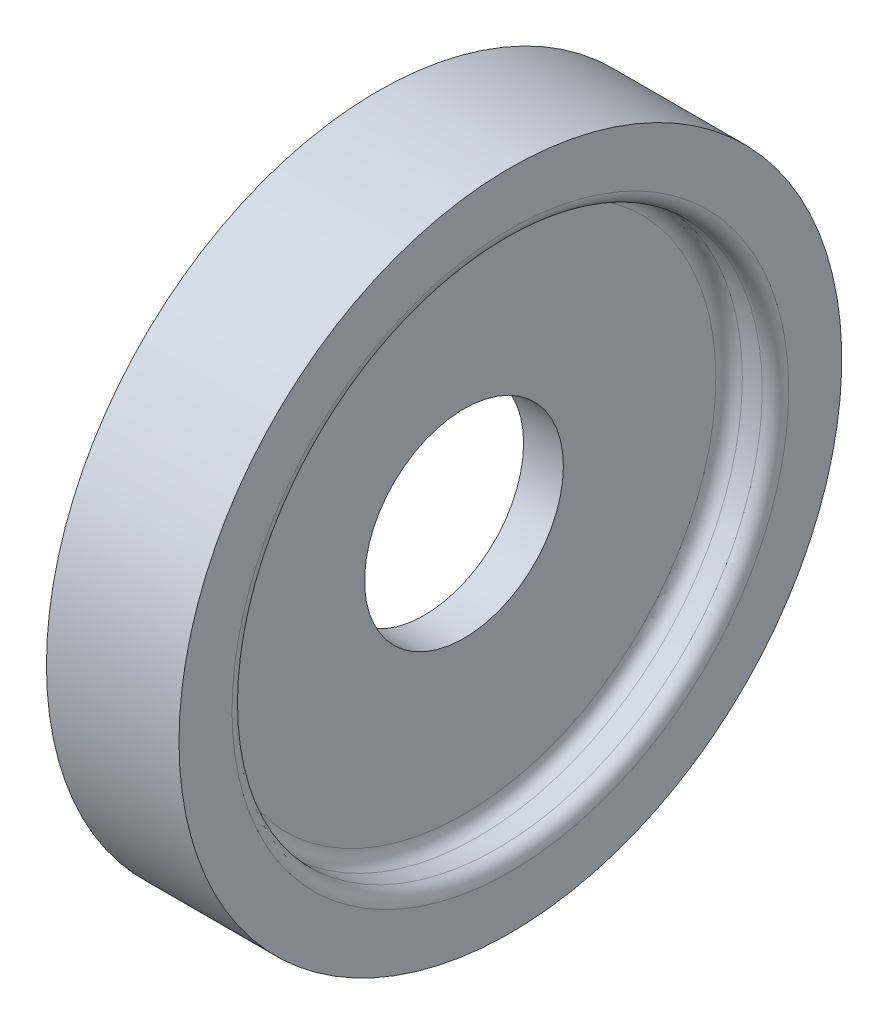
from build123d import *

# Parameters (mm, degrees)
CUT_EXTRUDE1_REACH = 37.948
SKETCH2_R          = 7.5


with BuildPart() as part:
    # Sketch1 → Revolve1 (revolve)
    with BuildSketch(Plane.XY, mode=Mode.PRIVATE) as revolve1_sk:
        with BuildLine():
            Line((-1.5, 0), (1.5, 0))
            Line((1.5, 0), (1.5, 19))
            ThreePointArc((1.5, 19), (1.792893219, 19.707106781), (2.5, 20))
            Line((2.5, 20), (4, 20))
            ThreePointArc((4, 20), (4.707106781, 20.292893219), (5, 21))
            Line((5, 21), (5, 25))
            Line((5, 25), (-5, 25))
            Line((-5, 25), (-5, 21))
            ThreePointArc((-5, 21), (-4.707106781, 20.292893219), (-4, 20))
            Line((-4, 20), (-2.5, 20))
            ThreePointArc((-2.5, 20), (-1.792893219, 19.707106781), (-1.5, 19))
            Line((-1.5, 19), (-1.5, 0))
        make_face()
    revolve(revolve1_sk.sketch.rotate(Axis((-24.413962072, 0, 0), (1, 0, 0)), 90), axis=Axis((-24.413962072, 0, 0), (1, 0, 0)))

    # Sketch2 → Cut-Extrude1 (cut, up to next)
    with BuildSketch(Plane(origin=(1.5, 0, 0), x_dir=(0, 0, -1), z_dir=(1, 0, 0)), mode=Mode.PRIVATE) as cut_extrude1_sk1:
        Circle(SKETCH2_R)
    cut_extrude1_tool1 = extrude(cut_extrude1_sk1.sketch, amount=-CUT_EXTRUDE1_REACH, mode=Mode.PRIVATE) & part.part
    add(cut_extrude1_tool1.solids().sort_by_distance((1.5, 0, 0))[0], mode=Mode.SUBTRACT)


solid = part.part
